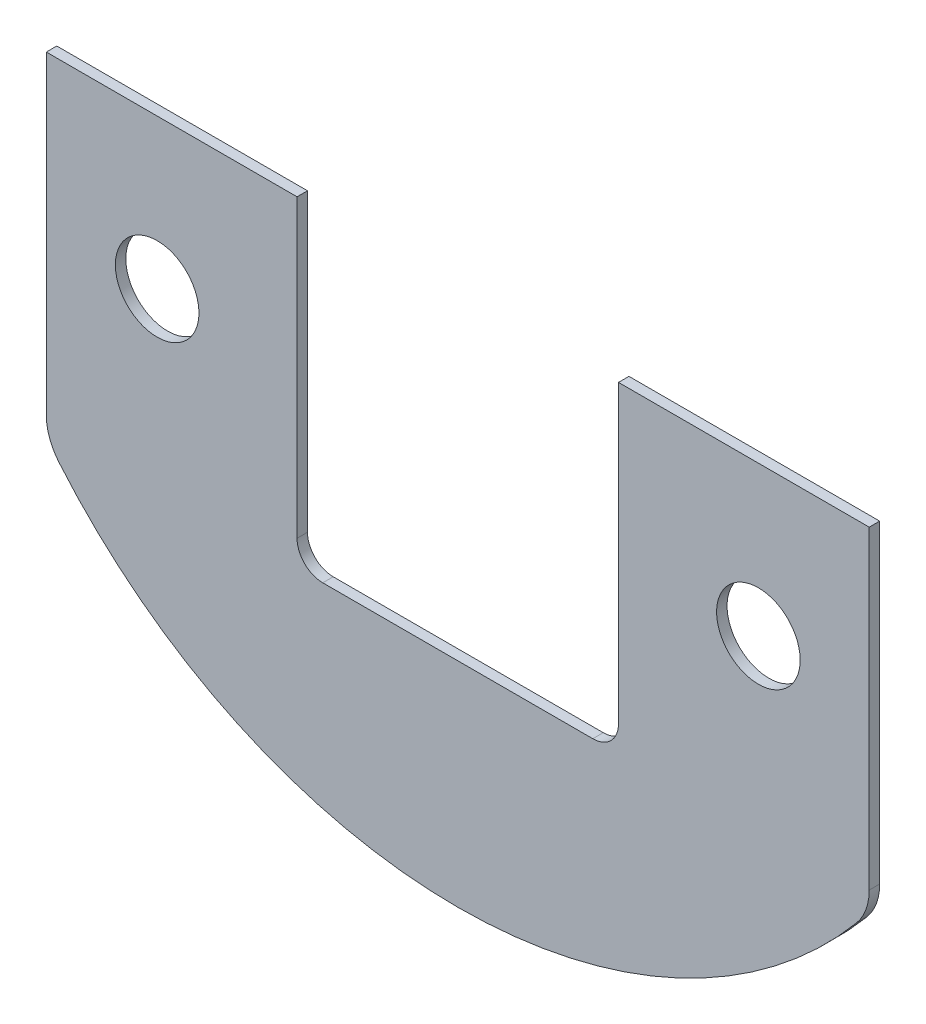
from build123d import *

# Parameters (mm, degrees)
BOSS_EXTRUDE1_DEPTH = 0.8128
FILLET1_R           = 2
SKETCH2_R           = 3.25
CUT_EXTRUDE1_DEPTH  = 53.493365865


with BuildPart() as part:
    # Sketch1 → Boss-Extrude1 (new body)
    with BuildSketch(Plane.XY):
        with BuildLine():
            Line((12.5, 0), (12.5, -25))
            Line((12.5, -25), (-12.5, -25))
            Line((-12.5, -25), (-12.5, 0))
            Line((-12.5, 0), (-32, 0))
            Line((-32, 0), (-32, -24.4463))
            ThreePointArc((-32, -24.4463), (-31.746532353, -25.883135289), (-31.016728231, -27.146514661))
            ThreePointArc((-31.016728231, -27.146514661), (0, -41.604), (31.016728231, -27.146514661))
            ThreePointArc((31.016728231, -27.146514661), (31.746532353, -25.883135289), (32, -24.4463))
            Line((32, -24.4463), (32, 0))
            Line((32, 0), (12.5, 0))
        make_face()
    extrude(amount=BOSS_EXTRUDE1_DEPTH)

    # Fillet1
    fillet1_edges = [part.edges().sort_by_distance(p)[0] for p in [
        (-12.5, -25, 0.4064),
        (12.5, -25, 0.4064),
    ]]
    fillet(fillet1_edges, radius=FILLET1_R)

    # Sketch2 → Cut-Extrude1 (cut, through all)
    with BuildSketch(Plane.XY.offset(0.8128)):
        with Locations(Location((-23.381119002, -11.643, 0), (0, 0, 180))):
            Circle(SKETCH2_R)
        with Locations((23.381119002, -11.643)):
            Circle(SKETCH2_R)
    extrude(amount=-CUT_EXTRUDE1_DEPTH, mode=Mode.SUBTRACT)


solid = part.part
